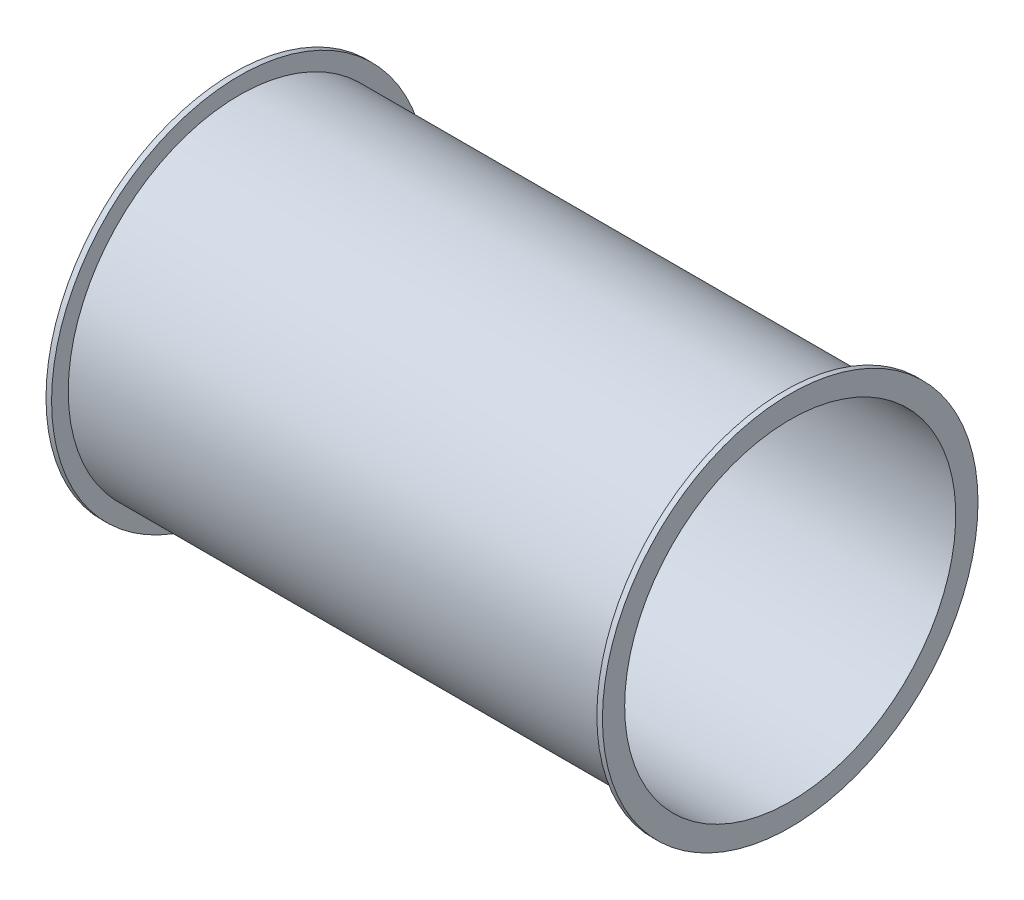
from build123d import *


with BuildPart() as part:
    # Sketch1 → Revolve2 (revolve)
    with BuildSketch(Plane.XY, mode=Mode.PRIVATE) as revolve2_sk:
        Polygon((-991.708967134, 61.5), (-795.708967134, 61.5), (-795.708967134, 67.5), (-793.708967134, 67.5), (-793.708967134, 59.5), (-993.708967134, 59.5), (-993.708967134, 61.5), (-993.708967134, 67.5), (-991.708967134, 67.5), align=None)
    revolve(revolve2_sk.sketch.rotate(Axis((-1176.949668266, 0, 0), (1, 0, 0)), 90), axis=Axis((-1176.949668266, 0, 0), (1, 0, 0)))


solid = part.part
